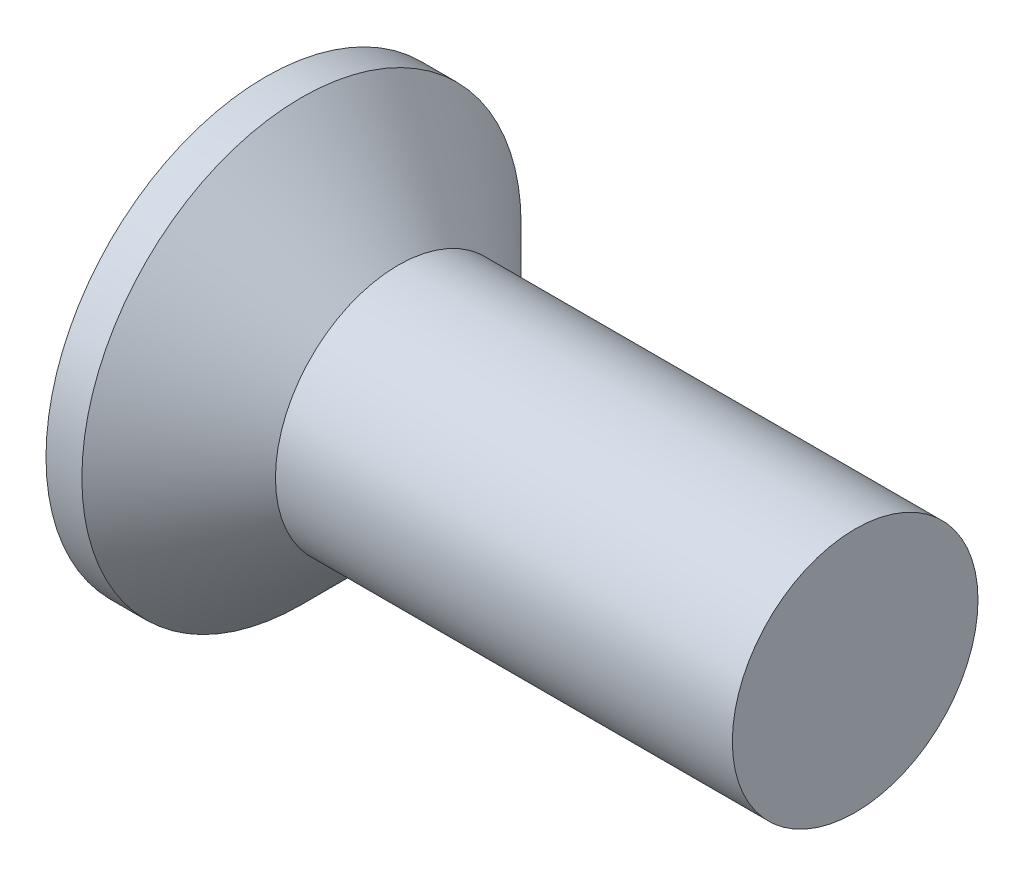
from build123d import *

# Parameters (mm, degrees)
CROSSRECESS_DEPTH = 1.35
DRAFT9_ANGLE      = 30
FILLET5_R         = 0.3


with BuildPart() as part:
    # Sketch1 → Base (revolve)
    with BuildSketch(Plane.XY, mode=Mode.PRIVATE) as base_sk:
        Polygon((12, 2.5), (4.3, 2.5), (2.7, 2.5), (0.73, 4.47), (0, 4.47), (0, 0), (12, 0), align=None)
    revolve(base_sk.sketch.rotate(Axis((4.515812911, 0, 0), (-1, 0, 0)), 90), axis=Axis((4.515812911, 0, 0), (-1, 0, 0)))

    # Sketch6 → CrossRecess (cut)
    with BuildSketch(Plane(origin=(0, 0, 0), x_dir=(0, 0, -1), z_dir=(1, 0, 0))):
        Polygon((0.52, 0.52), (0.52, 2.6), (-0.52, 2.6), (-0.52, 0.52), (-2.6, 0.52), (-2.6, -0.52), (-0.52, -0.52), (-0.52, -2.6), (0.52, -2.6), (0.52, -0.52), (2.6, -0.52), (2.6, 0.52), align=None)
    extrude(amount=CROSSRECESS_DEPTH, mode=Mode.SUBTRACT)

    # Draft9
    draft9_faces = [part.faces().sort_by_distance(p)[0] for p in [
        (0.675, 2.6, 0),
        (0.675, 0, 2.6),
        (0.675, -2.6, 0),
        (0.675, 0, -2.6),
    ]]
    draft(draft9_faces, Plane(origin=(0, 4.47, 0), x_dir=(0, 0, -1), z_dir=(-1, 0, 0)), DRAFT9_ANGLE)

    # Fillet5
    fillet5_edges = [part.edges().sort_by_distance(p)[0] for p in [
        (0.675, 0.52, 0.52),
        (0.675, -0.52, 0.52),
        (0.675, -0.52, -0.52),
        (0.675, 0.52, -0.52),
    ]]
    fillet(fillet5_edges, radius=FILLET5_R)


solid = part.part
